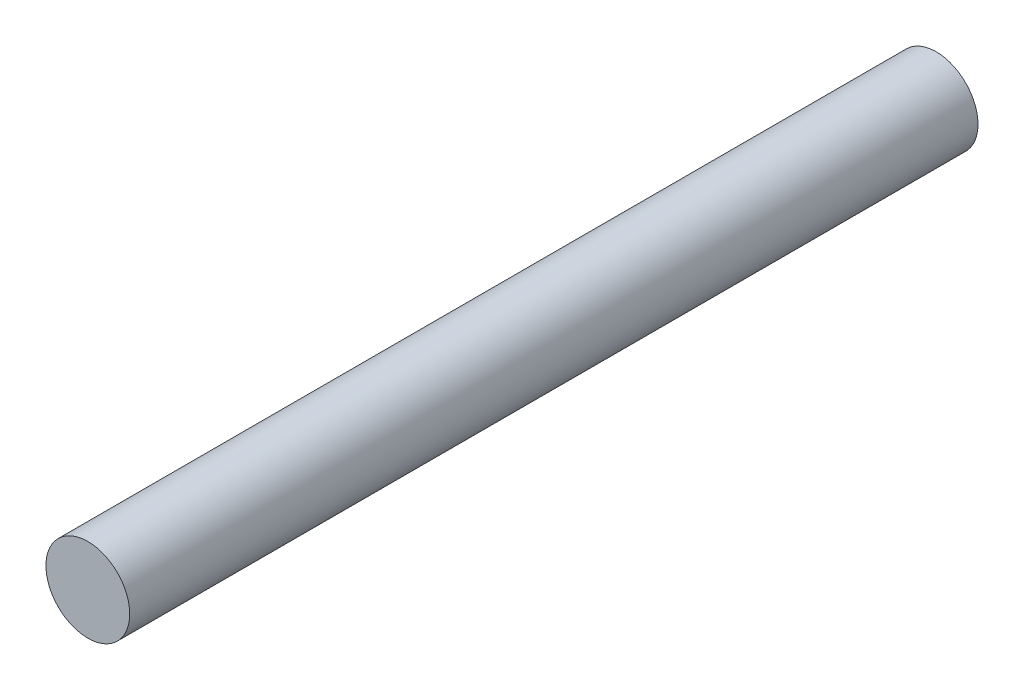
from build123d import *

# Parameters (mm, degrees)
SKETCH1_R           = 8
BOSS_EXTRUDE1_DEPTH = 162


with BuildPart() as part:
    # Sketch1 → Boss-Extrude1 (new body)
    with BuildSketch(Plane.XY):
        Circle(SKETCH1_R)
    extrude(amount=BOSS_EXTRUDE1_DEPTH)


solid = part.part
